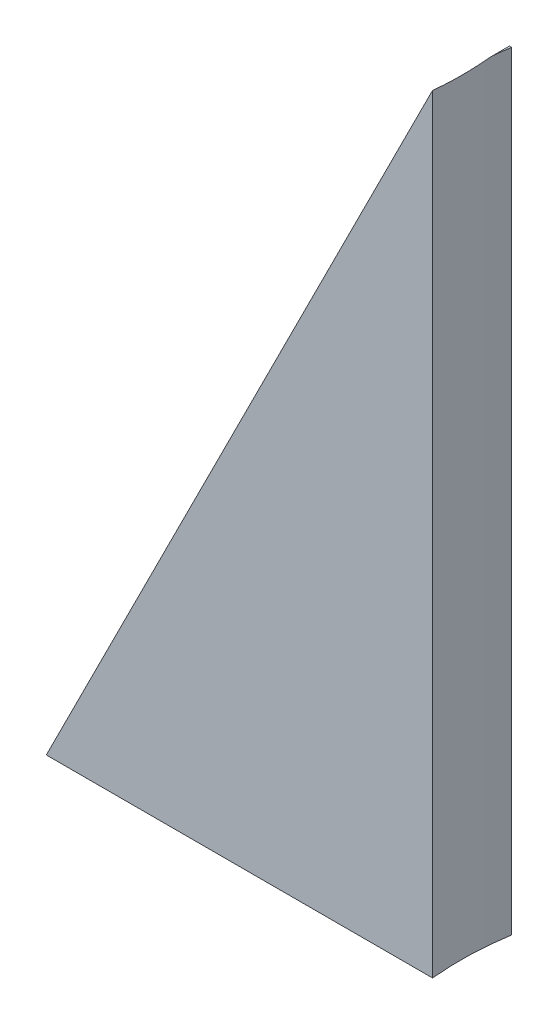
from build123d import *

# Parameters (mm, degrees)
BOSS_EXTRU_1_DEPTH      = 200
ENL_V_MAT_EXTRU_1_DEPTH = 200


with BuildPart() as part:
    # Esquisse1 → Boss.-Extru.1 (new body)
    with BuildSketch(Plane(origin=(0, 0, 0), x_dir=(1, 0, 0), z_dir=(0, 1, 0))):
        with BuildLine():
            Line((51.087051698, 10), (-50, 10))
            Line((-50, 10), (-50, -10))
            Line((-50, -10), (50.501256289, -10))
            ThreePointArc((50.501256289, -10), (50.146004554, 0.018984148), (51.087051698, 10))
        make_face()
    extrude(amount=BOSS_EXTRU_1_DEPTH)

    # Esquisse2 → Enl_v. mat.-Extru.1 (cut)
    with BuildSketch(Plane.XY.offset(10)):
        Polygon((-50, 0), (50.501256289, 200), (-50, 200), align=None)
    extrude(amount=-ENL_V_MAT_EXTRU_1_DEPTH, mode=Mode.SUBTRACT)


solid = part.part
